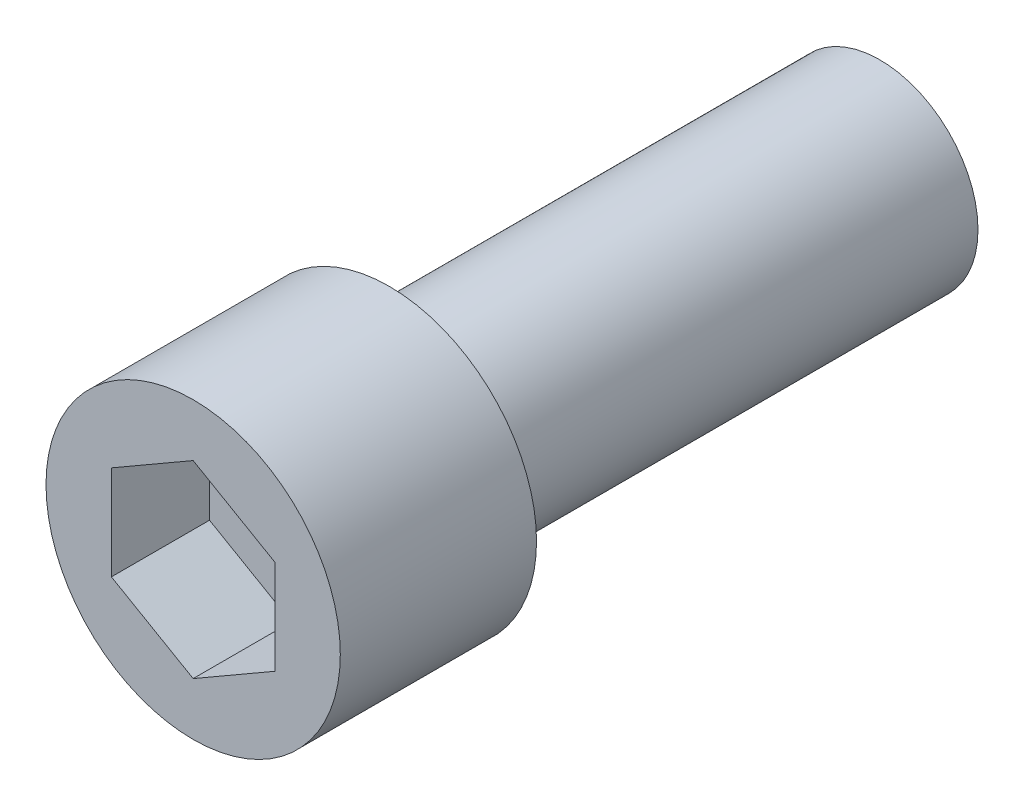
ISO-10303-21;
HEADER;
FILE_DESCRIPTION(('STEP AP214'),'2;1');
FILE_NAME('part.step','',(''),(''),'','','');
FILE_SCHEMA(('AUTOMOTIVE_DESIGN { 1 0 10303 214 1 1 1 1 }'));
ENDSEC;
DATA;
#1=APPLICATION_CONTEXT('core data for automotive mechanical design processes');
#2=APPLICATION_PROTOCOL_DEFINITION('international standard','automotive_design',2000,#1);
#3=PRODUCT_CONTEXT('',#1,'mechanical');
#4=PRODUCT('Part','Part','',(#3));
#5=PRODUCT_RELATED_PRODUCT_CATEGORY('part','',(#4));
#6=PRODUCT_DEFINITION_FORMATION('','',#4);
#7=PRODUCT_DEFINITION_CONTEXT('part definition',#1,'design');
#8=PRODUCT_DEFINITION('design','',#6,#7);
#9=PRODUCT_DEFINITION_SHAPE('','',#8);
#10=(LENGTH_UNIT() NAMED_UNIT(*) SI_UNIT(.MILLI.,.METRE.));
#11=(NAMED_UNIT(*) PLANE_ANGLE_UNIT() SI_UNIT($,.RADIAN.));
#12=(NAMED_UNIT(*) SI_UNIT($,.STERADIAN.) SOLID_ANGLE_UNIT());
#13=UNCERTAINTY_MEASURE_WITH_UNIT(LENGTH_MEASURE(1.E-05),#10,'distance_accuracy_value','');
#14=(GEOMETRIC_REPRESENTATION_CONTEXT(3) GLOBAL_UNCERTAINTY_ASSIGNED_CONTEXT((#13)) GLOBAL_UNIT_ASSIGNED_CONTEXT((#10,
#11,#12)) REPRESENTATION_CONTEXT('',''));
#15=CARTESIAN_POINT('',(0.,0.,0.));
#16=DIRECTION('',(0.,0.,1.));
#17=DIRECTION('',(1.,0.,0.));
#18=AXIS2_PLACEMENT_3D('',#15,#16,#17);
#19=CARTESIAN_POINT('',(0.,0.,-30.));
#20=DIRECTION('',(0.,0.,1.));
#21=DIRECTION('',(1.,0.,0.));
#22=AXIS2_PLACEMENT_3D('',#19,#20,#21);
#23=PLANE('',#22);
#24=CARTESIAN_POINT('',(0.,0.,-30.));
#25=DIRECTION('',(0.,0.,1.));
#26=DIRECTION('',(1.,0.,0.));
#27=AXIS2_PLACEMENT_3D('',#24,#25,#26);
#28=CIRCLE('',#27,6.);
#29=CARTESIAN_POINT('',(6.,0.,-30.));
#30=VERTEX_POINT('',#29);
#31=EDGE_CURVE('E9',#30,#30,#28,.T.);
#32=ORIENTED_EDGE('',*,*,#31,.F.);
#33=EDGE_LOOP('',(#32));
#34=FACE_BOUND('',#33,.T.);
#35=ADVANCED_FACE('F14',(#34),#23,.F.);
#36=CARTESIAN_POINT('',(0.,0.,150.));
#37=DIRECTION('',(0.,0.,1.));
#38=DIRECTION('',(1.,0.,0.));
#39=AXIS2_PLACEMENT_3D('',#36,#37,#38);
#40=CYLINDRICAL_SURFACE('',#39,6.);
#41=CARTESIAN_POINT('',(0.,0.,0.));
#42=DIRECTION('',(0.,0.,1.));
#43=DIRECTION('',(1.,0.,0.));
#44=AXIS2_PLACEMENT_3D('',#41,#42,#43);
#45=CIRCLE('',#44,6.);
#46=CARTESIAN_POINT('',(6.,0.,0.));
#47=VERTEX_POINT('',#46);
#48=EDGE_CURVE('E21',#47,#47,#45,.T.);
#49=ORIENTED_EDGE('',*,*,#48,.F.);
#50=EDGE_LOOP('',(#49));
#51=FACE_BOUND('',#50,.T.);
#52=ORIENTED_EDGE('',*,*,#31,.T.);
#53=EDGE_LOOP('',(#52));
#54=FACE_BOUND('',#53,.T.);
#55=ADVANCED_FACE('F132',(#51,#54),#40,.T.);
#56=CARTESIAN_POINT('',(-6.,0.,0.));
#57=DIRECTION('',(0.,0.,1.));
#58=DIRECTION('',(1.,0.,0.));
#59=AXIS2_PLACEMENT_3D('',#56,#57,#58);
#60=PLANE('',#59);
#61=CARTESIAN_POINT('',(0.,0.,0.));
#62=DIRECTION('',(0.,0.,1.));
#63=DIRECTION('',(1.,0.,0.));
#64=AXIS2_PLACEMENT_3D('',#61,#62,#63);
#65=CIRCLE('',#64,9.);
#66=CARTESIAN_POINT('',(9.,0.,0.));
#67=VERTEX_POINT('',#66);
#68=EDGE_CURVE('E125',#67,#67,#65,.T.);
#69=ORIENTED_EDGE('',*,*,#68,.F.);
#70=EDGE_LOOP('',(#69));
#71=FACE_BOUND('',#70,.T.);
#72=ORIENTED_EDGE('',*,*,#48,.T.);
#73=EDGE_LOOP('',(#72));
#74=FACE_BOUND('',#73,.T.);
#75=ADVANCED_FACE('F130',(#71,#74),#60,.F.);
#76=CARTESIAN_POINT('',(0.,0.,150.));
#77=DIRECTION('',(0.,0.,1.));
#78=DIRECTION('',(1.,0.,0.));
#79=AXIS2_PLACEMENT_3D('',#76,#77,#78);
#80=CYLINDRICAL_SURFACE('',#79,9.);
#81=CARTESIAN_POINT('',(0.,0.,12.));
#82=DIRECTION('',(0.,0.,1.));
#83=DIRECTION('',(1.,0.,0.));
#84=AXIS2_PLACEMENT_3D('',#81,#82,#83);
#85=CIRCLE('',#84,9.);
#86=CARTESIAN_POINT('',(9.,0.,12.));
#87=VERTEX_POINT('',#86);
#88=EDGE_CURVE('E116',#87,#87,#85,.T.);
#89=ORIENTED_EDGE('',*,*,#88,.F.);
#90=EDGE_LOOP('',(#89));
#91=FACE_BOUND('',#90,.T.);
#92=ORIENTED_EDGE('',*,*,#68,.T.);
#93=EDGE_LOOP('',(#92));
#94=FACE_BOUND('',#93,.T.);
#95=ADVANCED_FACE('F157',(#91,#94),#80,.T.);
#96=CARTESIAN_POINT('',(-9.,0.,12.));
#97=DIRECTION('',(0.,0.,-1.));
#98=DIRECTION('',(-1.,0.,0.));
#99=AXIS2_PLACEMENT_3D('',#96,#97,#98);
#100=PLANE('',#99);
#101=DIRECTION('',(-0.866025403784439,-0.5,0.));
#102=VECTOR('',#101,1.);
#103=CARTESIAN_POINT('',(0.,5.77350269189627,12.));
#104=LINE('',#103,#102);
#105=CARTESIAN_POINT('',(0.,5.77350269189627,12.));
#106=VERTEX_POINT('',#105);
#107=CARTESIAN_POINT('',(-5.,2.88675134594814,12.));
#108=VERTEX_POINT('',#107);
#109=EDGE_CURVE('E82',#106,#108,#104,.T.);
#110=ORIENTED_EDGE('',*,*,#109,.F.);
#111=DIRECTION('',(-0.866025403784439,0.5,0.));
#112=VECTOR('',#111,1.);
#113=CARTESIAN_POINT('',(5.,2.88675134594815,12.));
#114=LINE('',#113,#112);
#115=CARTESIAN_POINT('',(5.,2.88675134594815,12.));
#116=VERTEX_POINT('',#115);
#117=EDGE_CURVE('E28',#116,#106,#114,.T.);
#118=ORIENTED_EDGE('',*,*,#117,.F.);
#119=DIRECTION('',(0.,1.,0.));
#120=VECTOR('',#119,1.);
#121=CARTESIAN_POINT('',(5.,-2.88675134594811,12.));
#122=LINE('',#121,#120);
#123=CARTESIAN_POINT('',(5.,-2.88675134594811,12.));
#124=VERTEX_POINT('',#123);
#125=EDGE_CURVE('E98',#124,#116,#122,.T.);
#126=ORIENTED_EDGE('',*,*,#125,.F.);
#127=DIRECTION('',(0.866025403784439,0.5,0.));
#128=VECTOR('',#127,1.);
#129=CARTESIAN_POINT('',(0.,-5.77350269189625,12.));
#130=LINE('',#129,#128);
#131=CARTESIAN_POINT('',(0.,-5.77350269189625,12.));
#132=VERTEX_POINT('',#131);
#133=EDGE_CURVE('E92',#132,#124,#130,.T.);
#134=ORIENTED_EDGE('',*,*,#133,.F.);
#135=DIRECTION('',(0.866025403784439,-0.5,0.));
#136=VECTOR('',#135,1.);
#137=CARTESIAN_POINT('',(-5.,-2.88675134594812,12.));
#138=LINE('',#137,#136);
#139=CARTESIAN_POINT('',(-5.,-2.88675134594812,12.));
#140=VERTEX_POINT('',#139);
#141=EDGE_CURVE('E90',#140,#132,#138,.T.);
#142=ORIENTED_EDGE('',*,*,#141,.F.);
#143=DIRECTION('',(0.,-1.,0.));
#144=VECTOR('',#143,1.);
#145=CARTESIAN_POINT('',(-5.,2.88675134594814,12.));
#146=LINE('',#145,#144);
#147=EDGE_CURVE('E71',#108,#140,#146,.T.);
#148=ORIENTED_EDGE('',*,*,#147,.F.);
#149=EDGE_LOOP('',(#110,#118,#126,#134,#142,#148));
#150=FACE_BOUND('',#149,.T.);
#151=ORIENTED_EDGE('',*,*,#88,.T.);
#152=EDGE_LOOP('',(#151));
#153=FACE_BOUND('',#152,.T.);
#154=ADVANCED_FACE('F86',(#150,#153),#100,.F.);
#155=CARTESIAN_POINT('',(5.,2.88675134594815,6.));
#156=DIRECTION('',(0.5,0.866025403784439,0.));
#157=DIRECTION('',(-0.866025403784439,0.5,0.));
#158=AXIS2_PLACEMENT_3D('',#155,#156,#157);
#159=PLANE('',#158);
#160=ORIENTED_EDGE('',*,*,#117,.T.);
#161=DIRECTION('',(0.,0.,1.));
#162=VECTOR('',#161,1.);
#163=CARTESIAN_POINT('',(0.,5.77350269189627,6.));
#164=LINE('',#163,#162);
#165=CARTESIAN_POINT('',(0.,5.77350269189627,6.));
#166=VERTEX_POINT('',#165);
#167=EDGE_CURVE('E79',#166,#106,#164,.T.);
#168=ORIENTED_EDGE('',*,*,#167,.F.);
#169=DIRECTION('',(-0.866025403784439,0.5,0.));
#170=VECTOR('',#169,1.);
#171=CARTESIAN_POINT('',(5.,2.88675134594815,6.));
#172=LINE('',#171,#170);
#173=CARTESIAN_POINT('',(5.,2.88675134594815,6.));
#174=VERTEX_POINT('',#173);
#175=EDGE_CURVE('E100',#174,#166,#172,.T.);
#176=ORIENTED_EDGE('',*,*,#175,.F.);
#177=DIRECTION('',(0.,0.,1.));
#178=VECTOR('',#177,1.);
#179=CARTESIAN_POINT('',(5.,2.88675134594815,6.));
#180=LINE('',#179,#178);
#181=EDGE_CURVE('E35',#174,#116,#180,.T.);
#182=ORIENTED_EDGE('',*,*,#181,.T.);
#183=EDGE_LOOP('',(#160,#168,#176,#182));
#184=FACE_BOUND('',#183,.T.);
#185=ADVANCED_FACE('F174',(#184),#159,.F.);
#186=CARTESIAN_POINT('',(5.,-2.88675134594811,6.));
#187=DIRECTION('',(1.,0.,0.));
#188=DIRECTION('',(0.,1.,0.));
#189=AXIS2_PLACEMENT_3D('',#186,#187,#188);
#190=PLANE('',#189);
#191=ORIENTED_EDGE('',*,*,#125,.T.);
#192=ORIENTED_EDGE('',*,*,#181,.F.);
#193=DIRECTION('',(0.,1.,0.));
#194=VECTOR('',#193,1.);
#195=CARTESIAN_POINT('',(5.,-2.88675134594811,6.));
#196=LINE('',#195,#194);
#197=CARTESIAN_POINT('',(5.,-2.88675134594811,6.));
#198=VERTEX_POINT('',#197);
#199=EDGE_CURVE('E112',#198,#174,#196,.T.);
#200=ORIENTED_EDGE('',*,*,#199,.F.);
#201=DIRECTION('',(0.,0.,1.));
#202=VECTOR('',#201,1.);
#203=CARTESIAN_POINT('',(5.,-2.88675134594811,6.));
#204=LINE('',#203,#202);
#205=EDGE_CURVE('E117',#198,#124,#204,.T.);
#206=ORIENTED_EDGE('',*,*,#205,.T.);
#207=EDGE_LOOP('',(#191,#192,#200,#206));
#208=FACE_BOUND('',#207,.T.);
#209=ADVANCED_FACE('F182',(#208),#190,.F.);
#210=CARTESIAN_POINT('',(0.,-5.77350269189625,6.));
#211=DIRECTION('',(0.5,-0.866025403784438,0.));
#212=DIRECTION('',(0.866025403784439,0.5,0.));
#213=AXIS2_PLACEMENT_3D('',#210,#211,#212);
#214=PLANE('',#213);
#215=ORIENTED_EDGE('',*,*,#133,.T.);
#216=ORIENTED_EDGE('',*,*,#205,.F.);
#217=DIRECTION('',(0.866025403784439,0.5,0.));
#218=VECTOR('',#217,1.);
#219=CARTESIAN_POINT('',(0.,-5.77350269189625,6.));
#220=LINE('',#219,#218);
#221=CARTESIAN_POINT('',(0.,-5.77350269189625,6.));
#222=VERTEX_POINT('',#221);
#223=EDGE_CURVE('E109',#222,#198,#220,.T.);
#224=ORIENTED_EDGE('',*,*,#223,.F.);
#225=DIRECTION('',(0.,0.,1.));
#226=VECTOR('',#225,1.);
#227=CARTESIAN_POINT('',(0.,-5.77350269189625,6.));
#228=LINE('',#227,#226);
#229=EDGE_CURVE('E119',#222,#132,#228,.T.);
#230=ORIENTED_EDGE('',*,*,#229,.T.);
#231=EDGE_LOOP('',(#215,#216,#224,#230));
#232=FACE_BOUND('',#231,.T.);
#233=ADVANCED_FACE('F190',(#232),#214,.F.);
#234=CARTESIAN_POINT('',(-5.,-2.88675134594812,6.));
#235=DIRECTION('',(-0.5,-0.866025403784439,0.));
#236=DIRECTION('',(0.866025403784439,-0.5,0.));
#237=AXIS2_PLACEMENT_3D('',#234,#235,#236);
#238=PLANE('',#237);
#239=ORIENTED_EDGE('',*,*,#141,.T.);
#240=ORIENTED_EDGE('',*,*,#229,.F.);
#241=DIRECTION('',(0.866025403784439,-0.5,0.));
#242=VECTOR('',#241,1.);
#243=CARTESIAN_POINT('',(-5.,-2.88675134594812,6.));
#244=LINE('',#243,#242);
#245=CARTESIAN_POINT('',(-5.,-2.88675134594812,6.));
#246=VERTEX_POINT('',#245);
#247=EDGE_CURVE('E106',#246,#222,#244,.T.);
#248=ORIENTED_EDGE('',*,*,#247,.F.);
#249=DIRECTION('',(0.,0.,1.));
#250=VECTOR('',#249,1.);
#251=CARTESIAN_POINT('',(-5.,-2.88675134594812,6.));
#252=LINE('',#251,#250);
#253=EDGE_CURVE('E78',#246,#140,#252,.T.);
#254=ORIENTED_EDGE('',*,*,#253,.T.);
#255=EDGE_LOOP('',(#239,#240,#248,#254));
#256=FACE_BOUND('',#255,.T.);
#257=ADVANCED_FACE('F198',(#256),#238,.F.);
#258=CARTESIAN_POINT('',(-5.,2.88675134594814,6.));
#259=DIRECTION('',(-1.,0.,0.));
#260=DIRECTION('',(0.,-1.,0.));
#261=AXIS2_PLACEMENT_3D('',#258,#259,#260);
#262=PLANE('',#261);
#263=ORIENTED_EDGE('',*,*,#147,.T.);
#264=ORIENTED_EDGE('',*,*,#253,.F.);
#265=DIRECTION('',(0.,-1.,0.));
#266=VECTOR('',#265,1.);
#267=CARTESIAN_POINT('',(-5.,2.88675134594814,6.));
#268=LINE('',#267,#266);
#269=CARTESIAN_POINT('',(-5.,2.88675134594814,6.));
#270=VERTEX_POINT('',#269);
#271=EDGE_CURVE('E74',#270,#246,#268,.T.);
#272=ORIENTED_EDGE('',*,*,#271,.F.);
#273=DIRECTION('',(0.,0.,1.));
#274=VECTOR('',#273,1.);
#275=CARTESIAN_POINT('',(-5.,2.88675134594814,6.));
#276=LINE('',#275,#274);
#277=EDGE_CURVE('E67',#270,#108,#276,.T.);
#278=ORIENTED_EDGE('',*,*,#277,.T.);
#279=EDGE_LOOP('',(#263,#264,#272,#278));
#280=FACE_BOUND('',#279,.T.);
#281=ADVANCED_FACE('F69',(#280),#262,.F.);
#282=CARTESIAN_POINT('',(0.,5.77350269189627,6.));
#283=DIRECTION('',(-0.5,0.866025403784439,0.));
#284=DIRECTION('',(-0.866025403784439,-0.5,0.));
#285=AXIS2_PLACEMENT_3D('',#282,#283,#284);
#286=PLANE('',#285);
#287=ORIENTED_EDGE('',*,*,#109,.T.);
#288=ORIENTED_EDGE('',*,*,#277,.F.);
#289=DIRECTION('',(-0.866025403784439,-0.5,0.));
#290=VECTOR('',#289,1.);
#291=CARTESIAN_POINT('',(0.,5.77350269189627,6.));
#292=LINE('',#291,#290);
#293=EDGE_CURVE('E103',#166,#270,#292,.T.);
#294=ORIENTED_EDGE('',*,*,#293,.F.);
#295=ORIENTED_EDGE('',*,*,#167,.T.);
#296=EDGE_LOOP('',(#287,#288,#294,#295));
#297=FACE_BOUND('',#296,.T.);
#298=ADVANCED_FACE('F83',(#297),#286,.F.);
#299=CARTESIAN_POINT('',(5.,2.88675134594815,6.));
#300=DIRECTION('',(0.,0.,-1.));
#301=DIRECTION('',(-1.,0.,0.));
#302=AXIS2_PLACEMENT_3D('',#299,#300,#301);
#303=PLANE('',#302);
#304=ORIENTED_EDGE('',*,*,#175,.T.);
#305=ORIENTED_EDGE('',*,*,#293,.T.);
#306=ORIENTED_EDGE('',*,*,#271,.T.);
#307=ORIENTED_EDGE('',*,*,#247,.T.);
#308=ORIENTED_EDGE('',*,*,#223,.T.);
#309=ORIENTED_EDGE('',*,*,#199,.T.);
#310=EDGE_LOOP('',(#304,#305,#306,#307,#308,#309));
#311=FACE_BOUND('',#310,.T.);
#312=ADVANCED_FACE('F222',(#311),#303,.F.);
#313=CLOSED_SHELL('',(#35,#55,#75,#95,#154,#185,#209,#233,#257,#281,#298,#312));
#314=MANIFOLD_SOLID_BREP('B1',#313);
#315=ADVANCED_BREP_SHAPE_REPRESENTATION('',(#18,#314),#14);
#316=SHAPE_DEFINITION_REPRESENTATION(#9,#315);
ENDSEC;
END-ISO-10303-21;
